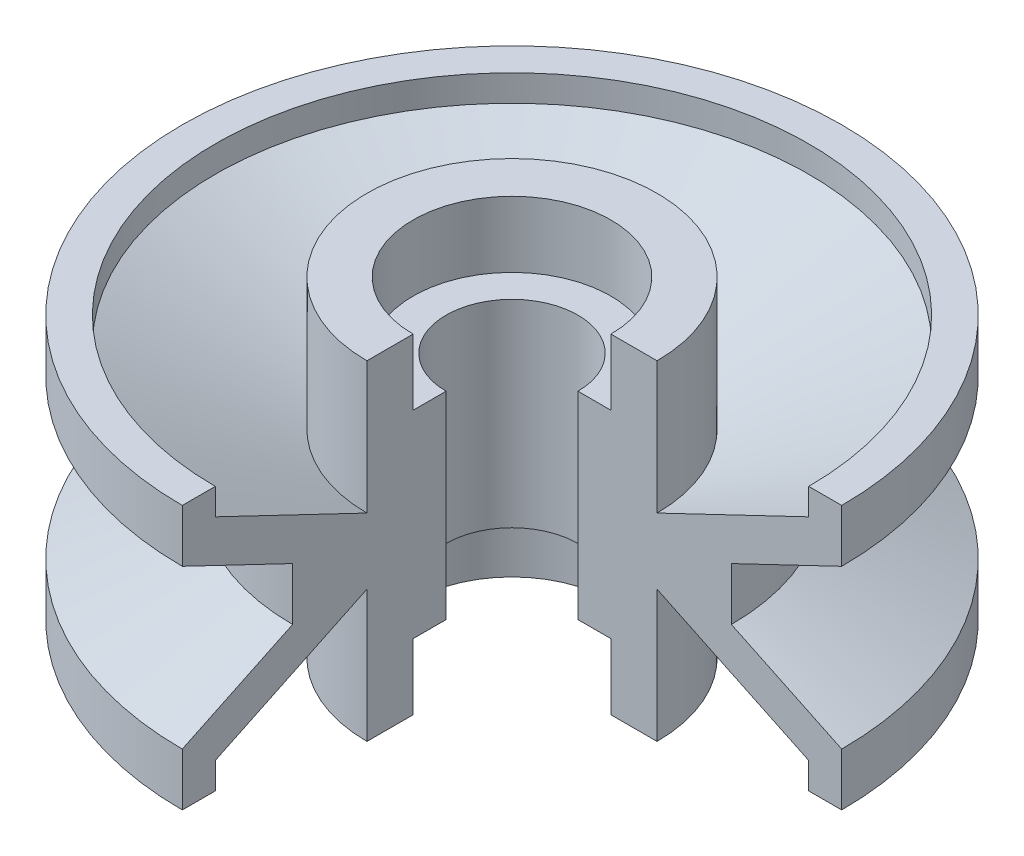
ISO-10303-21;
HEADER;
FILE_DESCRIPTION(('STEP AP214'),'2;1');
FILE_NAME('part.step','',(''),(''),'','','');
FILE_SCHEMA(('AUTOMOTIVE_DESIGN { 1 0 10303 214 1 1 1 1 }'));
ENDSEC;
DATA;
#1=APPLICATION_CONTEXT('core data for automotive mechanical design processes');
#2=APPLICATION_PROTOCOL_DEFINITION('international standard','automotive_design',2000,#1);
#3=PRODUCT_CONTEXT('',#1,'mechanical');
#4=PRODUCT('Part','Part','',(#3));
#5=PRODUCT_RELATED_PRODUCT_CATEGORY('part','',(#4));
#6=PRODUCT_DEFINITION_FORMATION('','',#4);
#7=PRODUCT_DEFINITION_CONTEXT('part definition',#1,'design');
#8=PRODUCT_DEFINITION('design','',#6,#7);
#9=PRODUCT_DEFINITION_SHAPE('','',#8);
#10=(LENGTH_UNIT() NAMED_UNIT(*) SI_UNIT(.MILLI.,.METRE.));
#11=(NAMED_UNIT(*) PLANE_ANGLE_UNIT() SI_UNIT($,.RADIAN.));
#12=(NAMED_UNIT(*) SI_UNIT($,.STERADIAN.) SOLID_ANGLE_UNIT());
#13=UNCERTAINTY_MEASURE_WITH_UNIT(LENGTH_MEASURE(1.E-05),#10,'distance_accuracy_value','');
#14=(GEOMETRIC_REPRESENTATION_CONTEXT(3) GLOBAL_UNCERTAINTY_ASSIGNED_CONTEXT((#13)) GLOBAL_UNIT_ASSIGNED_CONTEXT((#10,
#11,#12)) REPRESENTATION_CONTEXT('',''));
#15=CARTESIAN_POINT('',(0.,0.,0.));
#16=DIRECTION('',(0.,0.,1.));
#17=DIRECTION('',(1.,0.,0.));
#18=AXIS2_PLACEMENT_3D('',#15,#16,#17);
#19=CARTESIAN_POINT('',(1.33025439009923E-13,19.05,12.7));
#20=DIRECTION('',(0.,1.,0.));
#21=DIRECTION('',(0.,0.,1.));
#22=AXIS2_PLACEMENT_3D('',#19,#20,#21);
#23=PLANE('',#22);
#24=CARTESIAN_POINT('',(0.,19.05,0.));
#25=DIRECTION('',(0.,-1.,0.));
#26=DIRECTION('',(0.,0.,-1.));
#27=AXIS2_PLACEMENT_3D('',#24,#25,#26);
#28=CIRCLE('',#27,12.7);
#29=CARTESIAN_POINT('',(1.33025439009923E-13,19.05,12.7));
#30=VERTEX_POINT('',#29);
#31=CARTESIAN_POINT('',(12.7,19.05,0.));
#32=VERTEX_POINT('',#31);
#33=EDGE_CURVE('E11',#30,#32,#28,.T.);
#34=ORIENTED_EDGE('',*,*,#33,.T.);
#35=DIRECTION('',(-1.,0.,0.));
#36=VECTOR('',#35,1.);
#37=CARTESIAN_POINT('',(12.7,19.05,0.));
#38=LINE('',#37,#36);
#39=CARTESIAN_POINT('',(19.05,19.05,0.));
#40=VERTEX_POINT('',#39);
#41=EDGE_CURVE('E182',#40,#32,#38,.T.);
#42=ORIENTED_EDGE('',*,*,#41,.F.);
#43=CARTESIAN_POINT('',(0.,19.05,0.));
#44=DIRECTION('',(0.,-1.,0.));
#45=DIRECTION('',(0.,0.,-1.));
#46=AXIS2_PLACEMENT_3D('',#43,#44,#45);
#47=CIRCLE('',#46,19.05);
#48=CARTESIAN_POINT('',(1.99538158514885E-13,19.05,19.05));
#49=VERTEX_POINT('',#48);
#50=EDGE_CURVE('E61',#49,#40,#47,.T.);
#51=ORIENTED_EDGE('',*,*,#50,.F.);
#52=DIRECTION('',(0.,0.,-1.));
#53=VECTOR('',#52,1.);
#54=CARTESIAN_POINT('',(1.33025439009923E-13,19.05,12.7));
#55=LINE('',#54,#53);
#56=EDGE_CURVE('E184',#49,#30,#55,.T.);
#57=ORIENTED_EDGE('',*,*,#56,.T.);
#58=EDGE_LOOP('',(#34,#42,#51,#57));
#59=FACE_BOUND('',#58,.T.);
#60=ADVANCED_FACE('F45',(#59),#23,.T.);
#61=CARTESIAN_POINT('',(0.,0.,0.));
#62=DIRECTION('',(0.,-1.,0.));
#63=DIRECTION('',(0.,0.,-1.));
#64=AXIS2_PLACEMENT_3D('',#61,#62,#63);
#65=CYLINDRICAL_SURFACE('',#64,12.7);
#66=CARTESIAN_POINT('',(0.,-19.05,0.));
#67=DIRECTION('',(0.,-1.,0.));
#68=DIRECTION('',(0.,0.,-1.));
#69=AXIS2_PLACEMENT_3D('',#66,#67,#68);
#70=CIRCLE('',#69,12.7);
#71=CARTESIAN_POINT('',(1.33025439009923E-13,-19.05,12.7));
#72=VERTEX_POINT('',#71);
#73=CARTESIAN_POINT('',(12.7,-19.05,0.));
#74=VERTEX_POINT('',#73);
#75=EDGE_CURVE('E54',#72,#74,#70,.T.);
#76=ORIENTED_EDGE('',*,*,#75,.T.);
#77=DIRECTION('',(0.,-1.,0.));
#78=VECTOR('',#77,1.);
#79=CARTESIAN_POINT('',(12.7,-19.05,0.));
#80=LINE('',#79,#78);
#81=EDGE_CURVE('E193',#32,#74,#80,.T.);
#82=ORIENTED_EDGE('',*,*,#81,.F.);
#83=ORIENTED_EDGE('',*,*,#33,.F.);
#84=DIRECTION('',(0.,-1.,0.));
#85=VECTOR('',#84,1.);
#86=CARTESIAN_POINT('',(1.33025439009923E-13,-19.05,12.7));
#87=LINE('',#86,#85);
#88=EDGE_CURVE('E272',#30,#72,#87,.T.);
#89=ORIENTED_EDGE('',*,*,#88,.T.);
#90=EDGE_LOOP('',(#76,#82,#83,#89));
#91=FACE_BOUND('',#90,.T.);
#92=ADVANCED_FACE('F47',(#91),#65,.F.);
#93=CARTESIAN_POINT('',(1.33025439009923E-13,-19.05,12.7));
#94=DIRECTION('',(0.,-1.,0.));
#95=DIRECTION('',(0.,0.,-1.));
#96=AXIS2_PLACEMENT_3D('',#93,#94,#95);
#97=PLANE('',#96);
#98=CARTESIAN_POINT('',(0.,-19.05,0.));
#99=DIRECTION('',(0.,-1.,0.));
#100=DIRECTION('',(0.,0.,-1.));
#101=AXIS2_PLACEMENT_3D('',#98,#99,#100);
#102=CIRCLE('',#101,19.05);
#103=CARTESIAN_POINT('',(1.99538158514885E-13,-19.05,19.05));
#104=VERTEX_POINT('',#103);
#105=CARTESIAN_POINT('',(19.05,-19.05,0.));
#106=VERTEX_POINT('',#105);
#107=EDGE_CURVE('E394',#104,#106,#102,.T.);
#108=ORIENTED_EDGE('',*,*,#107,.T.);
#109=DIRECTION('',(1.,0.,0.));
#110=VECTOR('',#109,1.);
#111=CARTESIAN_POINT('',(12.7,-19.05,0.));
#112=LINE('',#111,#110);
#113=EDGE_CURVE('E200',#74,#106,#112,.T.);
#114=ORIENTED_EDGE('',*,*,#113,.F.);
#115=ORIENTED_EDGE('',*,*,#75,.F.);
#116=DIRECTION('',(0.,0.,1.));
#117=VECTOR('',#116,1.);
#118=CARTESIAN_POINT('',(1.33025439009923E-13,-19.05,12.7));
#119=LINE('',#118,#117);
#120=EDGE_CURVE('E275',#72,#104,#119,.T.);
#121=ORIENTED_EDGE('',*,*,#120,.T.);
#122=EDGE_LOOP('',(#108,#114,#115,#121));
#123=FACE_BOUND('',#122,.T.);
#124=ADVANCED_FACE('F398',(#123),#97,.T.);
#125=CARTESIAN_POINT('',(0.,0.,0.));
#126=DIRECTION('',(0.,-1.,0.));
#127=DIRECTION('',(0.,0.,-1.));
#128=AXIS2_PLACEMENT_3D('',#125,#126,#127);
#129=CYLINDRICAL_SURFACE('',#128,19.05);
#130=CARTESIAN_POINT('',(0.,-31.75,0.));
#131=DIRECTION('',(0.,-1.,0.));
#132=DIRECTION('',(0.,0.,-1.));
#133=AXIS2_PLACEMENT_3D('',#130,#131,#132);
#134=CIRCLE('',#133,19.05);
#135=CARTESIAN_POINT('',(1.99538158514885E-13,-31.75,19.05));
#136=VERTEX_POINT('',#135);
#137=CARTESIAN_POINT('',(19.05,-31.75,0.));
#138=VERTEX_POINT('',#137);
#139=EDGE_CURVE('E391',#136,#138,#134,.T.);
#140=ORIENTED_EDGE('',*,*,#139,.T.);
#141=DIRECTION('',(0.,-1.,0.));
#142=VECTOR('',#141,1.);
#143=CARTESIAN_POINT('',(19.05,-19.05,0.));
#144=LINE('',#143,#142);
#145=EDGE_CURVE('E203',#106,#138,#144,.T.);
#146=ORIENTED_EDGE('',*,*,#145,.F.);
#147=ORIENTED_EDGE('',*,*,#107,.F.);
#148=DIRECTION('',(0.,-1.,0.));
#149=VECTOR('',#148,1.);
#150=CARTESIAN_POINT('',(1.99538158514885E-13,-19.05,19.05));
#151=LINE('',#150,#149);
#152=EDGE_CURVE('E279',#104,#136,#151,.T.);
#153=ORIENTED_EDGE('',*,*,#152,.T.);
#154=EDGE_LOOP('',(#140,#146,#147,#153));
#155=FACE_BOUND('',#154,.T.);
#156=ADVANCED_FACE('F404',(#155),#129,.F.);
#157=CARTESIAN_POINT('',(1.99538158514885E-13,-31.75,19.05));
#158=DIRECTION('',(0.,-1.,0.));
#159=DIRECTION('',(0.,0.,-1.));
#160=AXIS2_PLACEMENT_3D('',#157,#158,#159);
#161=PLANE('',#160);
#162=CARTESIAN_POINT('',(0.,-31.75,0.));
#163=DIRECTION('',(0.,-1.,0.));
#164=DIRECTION('',(0.,0.,-1.));
#165=AXIS2_PLACEMENT_3D('',#162,#163,#164);
#166=CIRCLE('',#165,27.94);
#167=CARTESIAN_POINT('',(2.92655965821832E-13,-31.75,27.94));
#168=VERTEX_POINT('',#167);
#169=CARTESIAN_POINT('',(27.94,-31.75,0.));
#170=VERTEX_POINT('',#169);
#171=EDGE_CURVE('E388',#168,#170,#166,.T.);
#172=ORIENTED_EDGE('',*,*,#171,.T.);
#173=DIRECTION('',(1.,0.,0.));
#174=VECTOR('',#173,1.);
#175=CARTESIAN_POINT('',(19.05,-31.75,0.));
#176=LINE('',#175,#174);
#177=EDGE_CURVE('E209',#138,#170,#176,.T.);
#178=ORIENTED_EDGE('',*,*,#177,.F.);
#179=ORIENTED_EDGE('',*,*,#139,.F.);
#180=DIRECTION('',(0.,0.,1.));
#181=VECTOR('',#180,1.);
#182=CARTESIAN_POINT('',(1.99538158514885E-13,-31.75,19.05));
#183=LINE('',#182,#181);
#184=EDGE_CURVE('E283',#136,#168,#183,.T.);
#185=ORIENTED_EDGE('',*,*,#184,.T.);
#186=EDGE_LOOP('',(#172,#178,#179,#185));
#187=FACE_BOUND('',#186,.T.);
#188=ADVANCED_FACE('F407',(#187),#161,.T.);
#189=CARTESIAN_POINT('',(0.,0.,0.));
#190=DIRECTION('',(0.,-1.,0.));
#191=DIRECTION('',(0.,0.,-1.));
#192=AXIS2_PLACEMENT_3D('',#189,#190,#191);
#193=CYLINDRICAL_SURFACE('',#192,27.94);
#194=CARTESIAN_POINT('',(0.,-6.35,0.));
#195=DIRECTION('',(0.,-1.,0.));
#196=DIRECTION('',(0.,0.,-1.));
#197=AXIS2_PLACEMENT_3D('',#194,#195,#196);
#198=CIRCLE('',#197,27.94);
#199=CARTESIAN_POINT('',(2.92655965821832E-13,-6.35,27.94));
#200=VERTEX_POINT('',#199);
#201=CARTESIAN_POINT('',(27.94,-6.35,0.));
#202=VERTEX_POINT('',#201);
#203=EDGE_CURVE('E385',#200,#202,#198,.T.);
#204=ORIENTED_EDGE('',*,*,#203,.T.);
#205=DIRECTION('',(0.,1.,0.));
#206=VECTOR('',#205,1.);
#207=CARTESIAN_POINT('',(27.94,-31.75,0.));
#208=LINE('',#207,#206);
#209=EDGE_CURVE('E213',#170,#202,#208,.T.);
#210=ORIENTED_EDGE('',*,*,#209,.F.);
#211=ORIENTED_EDGE('',*,*,#171,.F.);
#212=DIRECTION('',(0.,1.,0.));
#213=VECTOR('',#212,1.);
#214=CARTESIAN_POINT('',(2.92655965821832E-13,-31.75,27.94));
#215=LINE('',#214,#213);
#216=EDGE_CURVE('E287',#168,#200,#215,.T.);
#217=ORIENTED_EDGE('',*,*,#216,.T.);
#218=EDGE_LOOP('',(#204,#210,#211,#217));
#219=FACE_BOUND('',#218,.T.);
#220=ADVANCED_FACE('F412',(#219),#193,.T.);
#221=CARTESIAN_POINT('',(0.,-6.35,0.));
#222=DIRECTION('',(0.,-1.,0.));
#223=DIRECTION('',(0.,0.,-1.));
#224=AXIS2_PLACEMENT_3D('',#221,#222,#223);
#225=CONICAL_SURFACE('',#224,27.94,1.12469077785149);
#226=CARTESIAN_POINT('',(0.,-20.32,0.));
#227=DIRECTION('',(0.,-1.,0.));
#228=DIRECTION('',(0.,0.,-1.));
#229=AXIS2_PLACEMENT_3D('',#226,#227,#228);
#230=CIRCLE('',#229,57.15);
#231=CARTESIAN_POINT('',(5.98614475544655E-13,-20.32,57.15));
#232=VERTEX_POINT('',#231);
#233=CARTESIAN_POINT('',(57.15,-20.32,0.));
#234=VERTEX_POINT('',#233);
#235=EDGE_CURVE('E382',#232,#234,#230,.T.);
#236=ORIENTED_EDGE('',*,*,#235,.T.);
#237=DIRECTION('',(0.902134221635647,-0.431455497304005,0.));
#238=VECTOR('',#237,1.);
#239=CARTESIAN_POINT('',(27.94,-6.35,0.));
#240=LINE('',#239,#238);
#241=EDGE_CURVE('E217',#202,#234,#240,.T.);
#242=ORIENTED_EDGE('',*,*,#241,.F.);
#243=ORIENTED_EDGE('',*,*,#203,.F.);
#244=DIRECTION('',(0.,-0.431455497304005,0.902134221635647));
#245=VECTOR('',#244,1.);
#246=CARTESIAN_POINT('',(2.92655965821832E-13,-6.35,27.94));
#247=LINE('',#246,#245);
#248=EDGE_CURVE('E291',#200,#232,#247,.T.);
#249=ORIENTED_EDGE('',*,*,#248,.T.);
#250=EDGE_LOOP('',(#236,#242,#243,#249));
#251=FACE_BOUND('',#250,.T.);
#252=ADVANCED_FACE('F415',(#251),#225,.F.);
#253=CARTESIAN_POINT('',(0.,0.,0.));
#254=DIRECTION('',(0.,-1.,0.));
#255=DIRECTION('',(0.,0.,-1.));
#256=AXIS2_PLACEMENT_3D('',#253,#254,#255);
#257=CYLINDRICAL_SURFACE('',#256,57.15);
#258=CARTESIAN_POINT('',(0.,-25.4,0.));
#259=DIRECTION('',(0.,-1.,0.));
#260=DIRECTION('',(0.,0.,-1.));
#261=AXIS2_PLACEMENT_3D('',#258,#259,#260);
#262=CIRCLE('',#261,57.15);
#263=CARTESIAN_POINT('',(5.98614475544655E-13,-25.4,57.15));
#264=VERTEX_POINT('',#263);
#265=CARTESIAN_POINT('',(57.15,-25.4,0.));
#266=VERTEX_POINT('',#265);
#267=EDGE_CURVE('E379',#264,#266,#262,.T.);
#268=ORIENTED_EDGE('',*,*,#267,.T.);
#269=DIRECTION('',(0.,-1.,0.));
#270=VECTOR('',#269,1.);
#271=CARTESIAN_POINT('',(57.15,-20.32,0.));
#272=LINE('',#271,#270);
#273=EDGE_CURVE('E221',#234,#266,#272,.T.);
#274=ORIENTED_EDGE('',*,*,#273,.F.);
#275=ORIENTED_EDGE('',*,*,#235,.F.);
#276=DIRECTION('',(0.,-1.,0.));
#277=VECTOR('',#276,1.);
#278=CARTESIAN_POINT('',(5.98614475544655E-13,-20.32,57.15));
#279=LINE('',#278,#277);
#280=EDGE_CURVE('E295',#232,#264,#279,.T.);
#281=ORIENTED_EDGE('',*,*,#280,.T.);
#282=EDGE_LOOP('',(#268,#274,#275,#281));
#283=FACE_BOUND('',#282,.T.);
#284=ADVANCED_FACE('F420',(#283),#257,.F.);
#285=CARTESIAN_POINT('',(5.98614475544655E-13,-25.4,57.15));
#286=DIRECTION('',(0.,-1.,0.));
#287=DIRECTION('',(0.,0.,-1.));
#288=AXIS2_PLACEMENT_3D('',#285,#286,#287);
#289=PLANE('',#288);
#290=CARTESIAN_POINT('',(0.,-25.4,0.));
#291=DIRECTION('',(0.,-1.,0.));
#292=DIRECTION('',(0.,0.,-1.));
#293=AXIS2_PLACEMENT_3D('',#290,#291,#292);
#294=CIRCLE('',#293,63.5);
#295=CARTESIAN_POINT('',(6.65127195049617E-13,-25.4,63.5));
#296=VERTEX_POINT('',#295);
#297=CARTESIAN_POINT('',(63.5,-25.4,0.));
#298=VERTEX_POINT('',#297);
#299=EDGE_CURVE('E376',#296,#298,#294,.T.);
#300=ORIENTED_EDGE('',*,*,#299,.T.);
#301=DIRECTION('',(1.,0.,0.));
#302=VECTOR('',#301,1.);
#303=CARTESIAN_POINT('',(57.15,-25.4,0.));
#304=LINE('',#303,#302);
#305=EDGE_CURVE('E225',#266,#298,#304,.T.);
#306=ORIENTED_EDGE('',*,*,#305,.F.);
#307=ORIENTED_EDGE('',*,*,#267,.F.);
#308=DIRECTION('',(0.,0.,1.));
#309=VECTOR('',#308,1.);
#310=CARTESIAN_POINT('',(5.98614475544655E-13,-25.4,57.15));
#311=LINE('',#310,#309);
#312=EDGE_CURVE('E299',#264,#296,#311,.T.);
#313=ORIENTED_EDGE('',*,*,#312,.T.);
#314=EDGE_LOOP('',(#300,#306,#307,#313));
#315=FACE_BOUND('',#314,.T.);
#316=ADVANCED_FACE('F423',(#315),#289,.T.);
#317=CARTESIAN_POINT('',(0.,0.,0.));
#318=DIRECTION('',(0.,-1.,0.));
#319=DIRECTION('',(0.,0.,-1.));
#320=AXIS2_PLACEMENT_3D('',#317,#318,#319);
#321=CYLINDRICAL_SURFACE('',#320,63.5);
#322=CARTESIAN_POINT('',(0.,-15.24,0.));
#323=DIRECTION('',(0.,-1.,0.));
#324=DIRECTION('',(0.,0.,-1.));
#325=AXIS2_PLACEMENT_3D('',#322,#323,#324);
#326=CIRCLE('',#325,63.5);
#327=CARTESIAN_POINT('',(6.65127195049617E-13,-15.24,63.5));
#328=VERTEX_POINT('',#327);
#329=CARTESIAN_POINT('',(63.5,-15.24,0.));
#330=VERTEX_POINT('',#329);
#331=EDGE_CURVE('E373',#328,#330,#326,.T.);
#332=ORIENTED_EDGE('',*,*,#331,.T.);
#333=DIRECTION('',(0.,1.,0.));
#334=VECTOR('',#333,1.);
#335=CARTESIAN_POINT('',(63.5,-25.4,0.));
#336=LINE('',#335,#334);
#337=EDGE_CURVE('E229',#298,#330,#336,.T.);
#338=ORIENTED_EDGE('',*,*,#337,.F.);
#339=ORIENTED_EDGE('',*,*,#299,.F.);
#340=DIRECTION('',(0.,1.,0.));
#341=VECTOR('',#340,1.);
#342=CARTESIAN_POINT('',(6.65127195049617E-13,-25.4,63.5));
#343=LINE('',#342,#341);
#344=EDGE_CURVE('E303',#296,#328,#343,.T.);
#345=ORIENTED_EDGE('',*,*,#344,.T.);
#346=EDGE_LOOP('',(#332,#338,#339,#345));
#347=FACE_BOUND('',#346,.T.);
#348=ADVANCED_FACE('F428',(#347),#321,.T.);
#349=CARTESIAN_POINT('',(0.,-15.24,0.));
#350=DIRECTION('',(0.,-1.,0.));
#351=DIRECTION('',(0.,0.,-1.));
#352=AXIS2_PLACEMENT_3D('',#349,#350,#351);
#353=CONICAL_SURFACE('',#352,63.5,1.12469077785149);
#354=CARTESIAN_POINT('',(0.,-5.08,0.));
#355=DIRECTION('',(0.,-1.,0.));
#356=DIRECTION('',(0.,0.,-1.));
#357=AXIS2_PLACEMENT_3D('',#354,#355,#356);
#358=CIRCLE('',#357,42.2563636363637);
#359=CARTESIAN_POINT('',(4.426119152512E-13,-5.08,42.2563636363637));
#360=VERTEX_POINT('',#359);
#361=CARTESIAN_POINT('',(42.2563636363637,-5.08,0.));
#362=VERTEX_POINT('',#361);
#363=EDGE_CURVE('E370',#360,#362,#358,.T.);
#364=ORIENTED_EDGE('',*,*,#363,.T.);
#365=DIRECTION('',(-0.902134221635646,0.431455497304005,0.));
#366=VECTOR('',#365,1.);
#367=CARTESIAN_POINT('',(63.5,-15.24,0.));
#368=LINE('',#367,#366);
#369=EDGE_CURVE('E233',#330,#362,#368,.T.);
#370=ORIENTED_EDGE('',*,*,#369,.F.);
#371=ORIENTED_EDGE('',*,*,#331,.F.);
#372=DIRECTION('',(0.,0.431455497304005,-0.902134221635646));
#373=VECTOR('',#372,1.);
#374=CARTESIAN_POINT('',(6.65127195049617E-13,-15.24,63.5));
#375=LINE('',#374,#373);
#376=EDGE_CURVE('E307',#328,#360,#375,.T.);
#377=ORIENTED_EDGE('',*,*,#376,.T.);
#378=EDGE_LOOP('',(#364,#370,#371,#377));
#379=FACE_BOUND('',#378,.T.);
#380=ADVANCED_FACE('F431',(#379),#353,.T.);
#381=CARTESIAN_POINT('',(0.,0.,0.));
#382=DIRECTION('',(0.,-1.,0.));
#383=DIRECTION('',(0.,0.,-1.));
#384=AXIS2_PLACEMENT_3D('',#381,#382,#383);
#385=CYLINDRICAL_SURFACE('',#384,42.2563636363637);
#386=CARTESIAN_POINT('',(0.,5.08,0.));
#387=DIRECTION('',(0.,-1.,0.));
#388=DIRECTION('',(0.,0.,-1.));
#389=AXIS2_PLACEMENT_3D('',#386,#387,#388);
#390=CIRCLE('',#389,42.2563636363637);
#391=CARTESIAN_POINT('',(4.426119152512E-13,5.08,42.2563636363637));
#392=VERTEX_POINT('',#391);
#393=CARTESIAN_POINT('',(42.2563636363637,5.08,0.));
#394=VERTEX_POINT('',#393);
#395=EDGE_CURVE('E367',#392,#394,#390,.T.);
#396=ORIENTED_EDGE('',*,*,#395,.T.);
#397=DIRECTION('',(0.,1.,0.));
#398=VECTOR('',#397,1.);
#399=CARTESIAN_POINT('',(42.2563636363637,5.08,0.));
#400=LINE('',#399,#398);
#401=EDGE_CURVE('E237',#362,#394,#400,.T.);
#402=ORIENTED_EDGE('',*,*,#401,.F.);
#403=ORIENTED_EDGE('',*,*,#363,.F.);
#404=DIRECTION('',(0.,1.,0.));
#405=VECTOR('',#404,1.);
#406=CARTESIAN_POINT('',(4.426119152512E-13,5.08,42.2563636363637));
#407=LINE('',#406,#405);
#408=EDGE_CURVE('E311',#360,#392,#407,.T.);
#409=ORIENTED_EDGE('',*,*,#408,.T.);
#410=EDGE_LOOP('',(#396,#402,#403,#409));
#411=FACE_BOUND('',#410,.T.);
#412=ADVANCED_FACE('F436',(#411),#385,.T.);
#413=CARTESIAN_POINT('',(0.,5.08,0.));
#414=DIRECTION('',(0.,1.,0.));
#415=DIRECTION('',(0.,0.,1.));
#416=AXIS2_PLACEMENT_3D('',#413,#414,#415);
#417=CONICAL_SURFACE('',#416,42.2563636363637,1.12469077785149);
#418=CARTESIAN_POINT('',(0.,15.24,0.));
#419=DIRECTION('',(0.,-1.,0.));
#420=DIRECTION('',(0.,0.,-1.));
#421=AXIS2_PLACEMENT_3D('',#418,#419,#420);
#422=CIRCLE('',#421,63.5);
#423=CARTESIAN_POINT('',(6.65127195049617E-13,15.24,63.5));
#424=VERTEX_POINT('',#423);
#425=CARTESIAN_POINT('',(63.5,15.24,0.));
#426=VERTEX_POINT('',#425);
#427=EDGE_CURVE('E364',#424,#426,#422,.T.);
#428=ORIENTED_EDGE('',*,*,#427,.T.);
#429=DIRECTION('',(0.902134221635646,0.431455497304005,0.));
#430=VECTOR('',#429,1.);
#431=CARTESIAN_POINT('',(63.5,15.24,0.));
#432=LINE('',#431,#430);
#433=EDGE_CURVE('E241',#394,#426,#432,.T.);
#434=ORIENTED_EDGE('',*,*,#433,.F.);
#435=ORIENTED_EDGE('',*,*,#395,.F.);
#436=DIRECTION('',(0.,0.431455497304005,0.902134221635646));
#437=VECTOR('',#436,1.);
#438=CARTESIAN_POINT('',(6.65127195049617E-13,15.24,63.5));
#439=LINE('',#438,#437);
#440=EDGE_CURVE('E315',#392,#424,#439,.T.);
#441=ORIENTED_EDGE('',*,*,#440,.T.);
#442=EDGE_LOOP('',(#428,#434,#435,#441));
#443=FACE_BOUND('',#442,.T.);
#444=ADVANCED_FACE('F439',(#443),#417,.T.);
#445=CARTESIAN_POINT('',(0.,0.,0.));
#446=DIRECTION('',(0.,-1.,0.));
#447=DIRECTION('',(0.,0.,-1.));
#448=AXIS2_PLACEMENT_3D('',#445,#446,#447);
#449=CYLINDRICAL_SURFACE('',#448,63.5);
#450=CARTESIAN_POINT('',(0.,25.4,0.));
#451=DIRECTION('',(0.,-1.,0.));
#452=DIRECTION('',(0.,0.,-1.));
#453=AXIS2_PLACEMENT_3D('',#450,#451,#452);
#454=CIRCLE('',#453,63.5);
#455=CARTESIAN_POINT('',(6.65127195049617E-13,25.4,63.5));
#456=VERTEX_POINT('',#455);
#457=CARTESIAN_POINT('',(63.5,25.4,0.));
#458=VERTEX_POINT('',#457);
#459=EDGE_CURVE('E361',#456,#458,#454,.T.);
#460=ORIENTED_EDGE('',*,*,#459,.T.);
#461=DIRECTION('',(0.,1.,0.));
#462=VECTOR('',#461,1.);
#463=CARTESIAN_POINT('',(63.5,25.4,0.));
#464=LINE('',#463,#462);
#465=EDGE_CURVE('E245',#426,#458,#464,.T.);
#466=ORIENTED_EDGE('',*,*,#465,.F.);
#467=ORIENTED_EDGE('',*,*,#427,.F.);
#468=DIRECTION('',(0.,1.,0.));
#469=VECTOR('',#468,1.);
#470=CARTESIAN_POINT('',(6.65127195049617E-13,25.4,63.5));
#471=LINE('',#470,#469);
#472=EDGE_CURVE('E319',#424,#456,#471,.T.);
#473=ORIENTED_EDGE('',*,*,#472,.T.);
#474=EDGE_LOOP('',(#460,#466,#467,#473));
#475=FACE_BOUND('',#474,.T.);
#476=ADVANCED_FACE('F444',(#475),#449,.T.);
#477=CARTESIAN_POINT('',(5.98614475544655E-13,25.4,57.15));
#478=DIRECTION('',(0.,1.,0.));
#479=DIRECTION('',(0.,0.,1.));
#480=AXIS2_PLACEMENT_3D('',#477,#478,#479);
#481=PLANE('',#480);
#482=CARTESIAN_POINT('',(0.,25.4,0.));
#483=DIRECTION('',(0.,-1.,0.));
#484=DIRECTION('',(0.,0.,-1.));
#485=AXIS2_PLACEMENT_3D('',#482,#483,#484);
#486=CIRCLE('',#485,57.15);
#487=CARTESIAN_POINT('',(5.98614475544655E-13,25.4,57.15));
#488=VERTEX_POINT('',#487);
#489=CARTESIAN_POINT('',(57.15,25.4,0.));
#490=VERTEX_POINT('',#489);
#491=EDGE_CURVE('E358',#488,#490,#486,.T.);
#492=ORIENTED_EDGE('',*,*,#491,.T.);
#493=DIRECTION('',(-1.,0.,0.));
#494=VECTOR('',#493,1.);
#495=CARTESIAN_POINT('',(57.15,25.4,0.));
#496=LINE('',#495,#494);
#497=EDGE_CURVE('E249',#458,#490,#496,.T.);
#498=ORIENTED_EDGE('',*,*,#497,.F.);
#499=ORIENTED_EDGE('',*,*,#459,.F.);
#500=DIRECTION('',(0.,0.,-1.));
#501=VECTOR('',#500,1.);
#502=CARTESIAN_POINT('',(5.98614475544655E-13,25.4,57.15));
#503=LINE('',#502,#501);
#504=EDGE_CURVE('E323',#456,#488,#503,.T.);
#505=ORIENTED_EDGE('',*,*,#504,.T.);
#506=EDGE_LOOP('',(#492,#498,#499,#505));
#507=FACE_BOUND('',#506,.T.);
#508=ADVANCED_FACE('F447',(#507),#481,.T.);
#509=CARTESIAN_POINT('',(0.,0.,0.));
#510=DIRECTION('',(0.,-1.,0.));
#511=DIRECTION('',(0.,0.,-1.));
#512=AXIS2_PLACEMENT_3D('',#509,#510,#511);
#513=CYLINDRICAL_SURFACE('',#512,57.15);
#514=CARTESIAN_POINT('',(0.,20.32,0.));
#515=DIRECTION('',(0.,-1.,0.));
#516=DIRECTION('',(0.,0.,-1.));
#517=AXIS2_PLACEMENT_3D('',#514,#515,#516);
#518=CIRCLE('',#517,57.15);
#519=CARTESIAN_POINT('',(5.98614475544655E-13,20.32,57.15));
#520=VERTEX_POINT('',#519);
#521=CARTESIAN_POINT('',(57.15,20.32,0.));
#522=VERTEX_POINT('',#521);
#523=EDGE_CURVE('E355',#520,#522,#518,.T.);
#524=ORIENTED_EDGE('',*,*,#523,.T.);
#525=DIRECTION('',(0.,-1.,0.));
#526=VECTOR('',#525,1.);
#527=CARTESIAN_POINT('',(57.15,20.32,0.));
#528=LINE('',#527,#526);
#529=EDGE_CURVE('E253',#490,#522,#528,.T.);
#530=ORIENTED_EDGE('',*,*,#529,.F.);
#531=ORIENTED_EDGE('',*,*,#491,.F.);
#532=DIRECTION('',(0.,-1.,0.));
#533=VECTOR('',#532,1.);
#534=CARTESIAN_POINT('',(5.98614475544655E-13,20.32,57.15));
#535=LINE('',#534,#533);
#536=EDGE_CURVE('E327',#488,#520,#535,.T.);
#537=ORIENTED_EDGE('',*,*,#536,.T.);
#538=EDGE_LOOP('',(#524,#530,#531,#537));
#539=FACE_BOUND('',#538,.T.);
#540=ADVANCED_FACE('F452',(#539),#513,.F.);
#541=CARTESIAN_POINT('',(0.,20.32,0.));
#542=DIRECTION('',(0.,1.,0.));
#543=DIRECTION('',(0.,0.,1.));
#544=AXIS2_PLACEMENT_3D('',#541,#542,#543);
#545=CONICAL_SURFACE('',#544,57.15,1.12469077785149);
#546=CARTESIAN_POINT('',(0.,6.34999999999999,0.));
#547=DIRECTION('',(0.,-1.,0.));
#548=DIRECTION('',(0.,0.,-1.));
#549=AXIS2_PLACEMENT_3D('',#546,#547,#548);
#550=CIRCLE('',#549,27.94);
#551=CARTESIAN_POINT('',(2.92655965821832E-13,6.34999999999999,27.94));
#552=VERTEX_POINT('',#551);
#553=CARTESIAN_POINT('',(27.94,6.34999999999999,0.));
#554=VERTEX_POINT('',#553);
#555=EDGE_CURVE('E352',#552,#554,#550,.T.);
#556=ORIENTED_EDGE('',*,*,#555,.T.);
#557=DIRECTION('',(-0.902134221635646,-0.431455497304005,0.));
#558=VECTOR('',#557,1.);
#559=CARTESIAN_POINT('',(27.94,6.34999999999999,0.));
#560=LINE('',#559,#558);
#561=EDGE_CURVE('E257',#522,#554,#560,.T.);
#562=ORIENTED_EDGE('',*,*,#561,.F.);
#563=ORIENTED_EDGE('',*,*,#523,.F.);
#564=DIRECTION('',(0.,-0.431455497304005,-0.902134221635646));
#565=VECTOR('',#564,1.);
#566=CARTESIAN_POINT('',(2.92655965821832E-13,6.34999999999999,27.94));
#567=LINE('',#566,#565);
#568=EDGE_CURVE('E331',#520,#552,#567,.T.);
#569=ORIENTED_EDGE('',*,*,#568,.T.);
#570=EDGE_LOOP('',(#556,#562,#563,#569));
#571=FACE_BOUND('',#570,.T.);
#572=ADVANCED_FACE('F455',(#571),#545,.F.);
#573=CARTESIAN_POINT('',(0.,0.,0.));
#574=DIRECTION('',(0.,-1.,0.));
#575=DIRECTION('',(0.,0.,-1.));
#576=AXIS2_PLACEMENT_3D('',#573,#574,#575);
#577=CYLINDRICAL_SURFACE('',#576,27.94);
#578=CARTESIAN_POINT('',(0.,31.75,0.));
#579=DIRECTION('',(0.,-1.,0.));
#580=DIRECTION('',(0.,0.,-1.));
#581=AXIS2_PLACEMENT_3D('',#578,#579,#580);
#582=CIRCLE('',#581,27.94);
#583=CARTESIAN_POINT('',(2.92655965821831E-13,31.75,27.94));
#584=VERTEX_POINT('',#583);
#585=CARTESIAN_POINT('',(27.94,31.75,0.));
#586=VERTEX_POINT('',#585);
#587=EDGE_CURVE('E349',#584,#586,#582,.T.);
#588=ORIENTED_EDGE('',*,*,#587,.T.);
#589=DIRECTION('',(0.,1.,0.));
#590=VECTOR('',#589,1.);
#591=CARTESIAN_POINT('',(27.94,31.75,0.));
#592=LINE('',#591,#590);
#593=EDGE_CURVE('E261',#554,#586,#592,.T.);
#594=ORIENTED_EDGE('',*,*,#593,.F.);
#595=ORIENTED_EDGE('',*,*,#555,.F.);
#596=DIRECTION('',(0.,1.,0.));
#597=VECTOR('',#596,1.);
#598=CARTESIAN_POINT('',(2.92655965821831E-13,31.75,27.94));
#599=LINE('',#598,#597);
#600=EDGE_CURVE('E335',#552,#584,#599,.T.);
#601=ORIENTED_EDGE('',*,*,#600,.T.);
#602=EDGE_LOOP('',(#588,#594,#595,#601));
#603=FACE_BOUND('',#602,.T.);
#604=ADVANCED_FACE('F460',(#603),#577,.T.);
#605=CARTESIAN_POINT('',(1.99538158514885E-13,31.75,19.05));
#606=DIRECTION('',(0.,1.,0.));
#607=DIRECTION('',(0.,0.,1.));
#608=AXIS2_PLACEMENT_3D('',#605,#606,#607);
#609=PLANE('',#608);
#610=CARTESIAN_POINT('',(0.,31.75,0.));
#611=DIRECTION('',(0.,-1.,0.));
#612=DIRECTION('',(0.,0.,-1.));
#613=AXIS2_PLACEMENT_3D('',#610,#611,#612);
#614=CIRCLE('',#613,19.05);
#615=CARTESIAN_POINT('',(1.99538158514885E-13,31.75,19.05));
#616=VERTEX_POINT('',#615);
#617=CARTESIAN_POINT('',(19.05,31.75,0.));
#618=VERTEX_POINT('',#617);
#619=EDGE_CURVE('E69',#616,#618,#614,.T.);
#620=ORIENTED_EDGE('',*,*,#619,.T.);
#621=DIRECTION('',(-1.,0.,0.));
#622=VECTOR('',#621,1.);
#623=CARTESIAN_POINT('',(19.05,31.75,0.));
#624=LINE('',#623,#622);
#625=EDGE_CURVE('E265',#586,#618,#624,.T.);
#626=ORIENTED_EDGE('',*,*,#625,.F.);
#627=ORIENTED_EDGE('',*,*,#587,.F.);
#628=DIRECTION('',(0.,0.,-1.));
#629=VECTOR('',#628,1.);
#630=CARTESIAN_POINT('',(1.99538158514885E-13,31.75,19.05));
#631=LINE('',#630,#629);
#632=EDGE_CURVE('E339',#584,#616,#631,.T.);
#633=ORIENTED_EDGE('',*,*,#632,.T.);
#634=EDGE_LOOP('',(#620,#626,#627,#633));
#635=FACE_BOUND('',#634,.T.);
#636=ADVANCED_FACE('F463',(#635),#609,.T.);
#637=CARTESIAN_POINT('',(0.,0.,0.));
#638=DIRECTION('',(0.,-1.,0.));
#639=DIRECTION('',(0.,0.,-1.));
#640=AXIS2_PLACEMENT_3D('',#637,#638,#639);
#641=CYLINDRICAL_SURFACE('',#640,19.05);
#642=DIRECTION('',(0.,-1.,0.));
#643=VECTOR('',#642,1.);
#644=CARTESIAN_POINT('',(1.99538158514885E-13,19.05,19.05));
#645=LINE('',#644,#643);
#646=EDGE_CURVE('E342',#616,#49,#645,.T.);
#647=ORIENTED_EDGE('',*,*,#646,.T.);
#648=ORIENTED_EDGE('',*,*,#50,.T.);
#649=DIRECTION('',(0.,-1.,0.));
#650=VECTOR('',#649,1.);
#651=CARTESIAN_POINT('',(19.05,19.05,0.));
#652=LINE('',#651,#650);
#653=EDGE_CURVE('E196',#618,#40,#652,.T.);
#654=ORIENTED_EDGE('',*,*,#653,.F.);
#655=ORIENTED_EDGE('',*,*,#619,.F.);
#656=EDGE_LOOP('',(#647,#648,#654,#655));
#657=FACE_BOUND('',#656,.T.);
#658=ADVANCED_FACE('F465',(#657),#641,.F.);
#659=CARTESIAN_POINT('',(0.,0.,0.));
#660=DIRECTION('',(-1.,0.,0.));
#661=DIRECTION('',(0.,0.,1.));
#662=AXIS2_PLACEMENT_3D('',#659,#660,#661);
#663=PLANE('',#662);
#664=ORIENTED_EDGE('',*,*,#56,.F.);
#665=ORIENTED_EDGE('',*,*,#646,.F.);
#666=ORIENTED_EDGE('',*,*,#632,.F.);
#667=ORIENTED_EDGE('',*,*,#600,.F.);
#668=ORIENTED_EDGE('',*,*,#568,.F.);
#669=ORIENTED_EDGE('',*,*,#536,.F.);
#670=ORIENTED_EDGE('',*,*,#504,.F.);
#671=ORIENTED_EDGE('',*,*,#472,.F.);
#672=ORIENTED_EDGE('',*,*,#440,.F.);
#673=ORIENTED_EDGE('',*,*,#408,.F.);
#674=ORIENTED_EDGE('',*,*,#376,.F.);
#675=ORIENTED_EDGE('',*,*,#344,.F.);
#676=ORIENTED_EDGE('',*,*,#312,.F.);
#677=ORIENTED_EDGE('',*,*,#280,.F.);
#678=ORIENTED_EDGE('',*,*,#248,.F.);
#679=ORIENTED_EDGE('',*,*,#216,.F.);
#680=ORIENTED_EDGE('',*,*,#184,.F.);
#681=ORIENTED_EDGE('',*,*,#152,.F.);
#682=ORIENTED_EDGE('',*,*,#120,.F.);
#683=ORIENTED_EDGE('',*,*,#88,.F.);
#684=EDGE_LOOP('',(#664,#665,#666,#667,#668,#669,#670,#671,#672,#673,#674,#675,#676,#677,#678,
#679,#680,#681,#682,#683));
#685=FACE_BOUND('',#684,.T.);
#686=ADVANCED_FACE('F467',(#685),#663,.F.);
#687=CARTESIAN_POINT('',(0.,0.,0.));
#688=DIRECTION('',(0.,0.,1.));
#689=DIRECTION('',(1.,0.,0.));
#690=AXIS2_PLACEMENT_3D('',#687,#688,#689);
#691=PLANE('',#690);
#692=ORIENTED_EDGE('',*,*,#41,.T.);
#693=ORIENTED_EDGE('',*,*,#81,.T.);
#694=ORIENTED_EDGE('',*,*,#113,.T.);
#695=ORIENTED_EDGE('',*,*,#145,.T.);
#696=ORIENTED_EDGE('',*,*,#177,.T.);
#697=ORIENTED_EDGE('',*,*,#209,.T.);
#698=ORIENTED_EDGE('',*,*,#241,.T.);
#699=ORIENTED_EDGE('',*,*,#273,.T.);
#700=ORIENTED_EDGE('',*,*,#305,.T.);
#701=ORIENTED_EDGE('',*,*,#337,.T.);
#702=ORIENTED_EDGE('',*,*,#369,.T.);
#703=ORIENTED_EDGE('',*,*,#401,.T.);
#704=ORIENTED_EDGE('',*,*,#433,.T.);
#705=ORIENTED_EDGE('',*,*,#465,.T.);
#706=ORIENTED_EDGE('',*,*,#497,.T.);
#707=ORIENTED_EDGE('',*,*,#529,.T.);
#708=ORIENTED_EDGE('',*,*,#561,.T.);
#709=ORIENTED_EDGE('',*,*,#593,.T.);
#710=ORIENTED_EDGE('',*,*,#625,.T.);
#711=ORIENTED_EDGE('',*,*,#653,.T.);
#712=EDGE_LOOP('',(#692,#693,#694,#695,#696,#697,#698,#699,#700,#701,#702,#703,#704,#705,#706,
#707,#708,#709,#710,#711));
#713=FACE_BOUND('',#712,.T.);
#714=ADVANCED_FACE('F191',(#713),#691,.T.);
#715=CLOSED_SHELL('',(#60,#92,#124,#156,#188,#220,#252,#284,#316,#348,#380,#412,#444,#476,#508,
#540,#572,#604,#636,#658,#686,#714));
#716=MANIFOLD_SOLID_BREP('B2',#715);
#717=ADVANCED_BREP_SHAPE_REPRESENTATION('',(#18,#716),#14);
#718=SHAPE_DEFINITION_REPRESENTATION(#9,#717);
ENDSEC;
END-ISO-10303-21;
